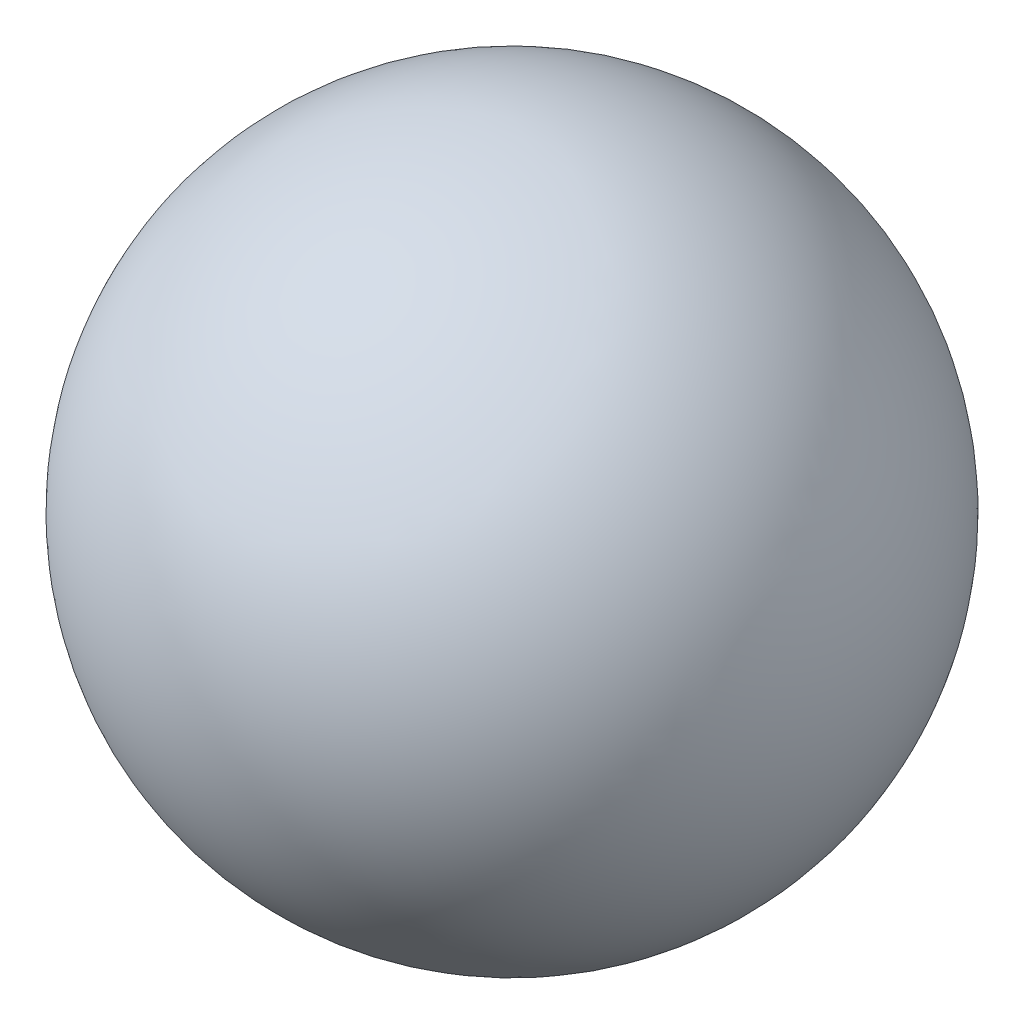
ISO-10303-21;
HEADER;
FILE_DESCRIPTION(('STEP AP214'),'2;1');
FILE_NAME('part.step','',(''),(''),'','','');
FILE_SCHEMA(('AUTOMOTIVE_DESIGN { 1 0 10303 214 1 1 1 1 }'));
ENDSEC;
DATA;
#1=APPLICATION_CONTEXT('core data for automotive mechanical design processes');
#2=APPLICATION_PROTOCOL_DEFINITION('international standard','automotive_design',2000,#1);
#3=PRODUCT_CONTEXT('',#1,'mechanical');
#4=PRODUCT('Part','Part','',(#3));
#5=PRODUCT_RELATED_PRODUCT_CATEGORY('part','',(#4));
#6=PRODUCT_DEFINITION_FORMATION('','',#4);
#7=PRODUCT_DEFINITION_CONTEXT('part definition',#1,'design');
#8=PRODUCT_DEFINITION('design','',#6,#7);
#9=PRODUCT_DEFINITION_SHAPE('','',#8);
#10=(LENGTH_UNIT() NAMED_UNIT(*) SI_UNIT(.MILLI.,.METRE.));
#11=(NAMED_UNIT(*) PLANE_ANGLE_UNIT() SI_UNIT($,.RADIAN.));
#12=(NAMED_UNIT(*) SI_UNIT($,.STERADIAN.) SOLID_ANGLE_UNIT());
#13=UNCERTAINTY_MEASURE_WITH_UNIT(LENGTH_MEASURE(1.E-05),#10,'distance_accuracy_value','');
#14=(GEOMETRIC_REPRESENTATION_CONTEXT(3) GLOBAL_UNCERTAINTY_ASSIGNED_CONTEXT((#13)) GLOBAL_UNIT_ASSIGNED_CONTEXT((#10,
#11,#12)) REPRESENTATION_CONTEXT('',''));
#15=CARTESIAN_POINT('',(0.,0.,0.));
#16=DIRECTION('',(0.,0.,1.));
#17=DIRECTION('',(1.,0.,0.));
#18=AXIS2_PLACEMENT_3D('',#15,#16,#17);
#19=CARTESIAN_POINT('',(3.2,0.,-3.2));
#20=DIRECTION('',(-1.,0.,0.));
#21=DIRECTION('',(0.,0.,-1.));
#22=AXIS2_PLACEMENT_3D('',#19,#20,#21);
#23=SPHERICAL_SURFACE('',#22,2.1);
#24=CARTESIAN_POINT('',(1.1,0.,-3.2));
#25=VERTEX_POINT('',#24);
#26=VERTEX_LOOP('',#25);
#27=FACE_BOUND('',#26,.T.);
#28=ADVANCED_FACE('F30',(#27),#23,.T.);
#29=CLOSED_SHELL('',(#28));
#30=MANIFOLD_SOLID_BREP('B2',#29);
#31=ADVANCED_BREP_SHAPE_REPRESENTATION('',(#18,#30),#14);
#32=SHAPE_DEFINITION_REPRESENTATION(#9,#31);
ENDSEC;
END-ISO-10303-21;
